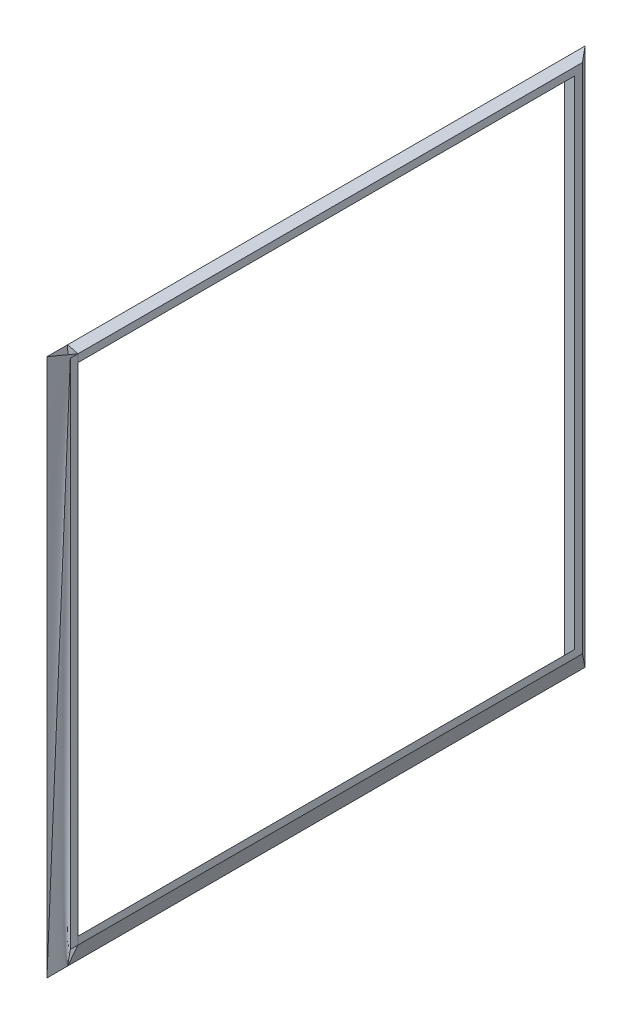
ISO-10303-21;
HEADER;
FILE_DESCRIPTION(('STEP AP214'),'2;1');
FILE_NAME('part.step','',(''),(''),'','','');
FILE_SCHEMA(('AUTOMOTIVE_DESIGN { 1 0 10303 214 1 1 1 1 }'));
ENDSEC;
DATA;
#1=APPLICATION_CONTEXT('core data for automotive mechanical design processes');
#2=APPLICATION_PROTOCOL_DEFINITION('international standard','automotive_design',2000,#1);
#3=PRODUCT_CONTEXT('',#1,'mechanical');
#4=PRODUCT('Part','Part','',(#3));
#5=PRODUCT_RELATED_PRODUCT_CATEGORY('part','',(#4));
#6=PRODUCT_DEFINITION_FORMATION('','',#4);
#7=PRODUCT_DEFINITION_CONTEXT('part definition',#1,'design');
#8=PRODUCT_DEFINITION('design','',#6,#7);
#9=PRODUCT_DEFINITION_SHAPE('','',#8);
#10=(LENGTH_UNIT() NAMED_UNIT(*) SI_UNIT(.MILLI.,.METRE.));
#11=(NAMED_UNIT(*) PLANE_ANGLE_UNIT() SI_UNIT($,.RADIAN.));
#12=(NAMED_UNIT(*) SI_UNIT($,.STERADIAN.) SOLID_ANGLE_UNIT());
#13=UNCERTAINTY_MEASURE_WITH_UNIT(LENGTH_MEASURE(1.E-05),#10,'distance_accuracy_value','');
#14=(GEOMETRIC_REPRESENTATION_CONTEXT(3) GLOBAL_UNCERTAINTY_ASSIGNED_CONTEXT((#13)) GLOBAL_UNIT_ASSIGNED_CONTEXT((#10,
#11,#12)) REPRESENTATION_CONTEXT('',''));
#15=CARTESIAN_POINT('',(0.,0.,0.));
#16=DIRECTION('',(0.,0.,1.));
#17=DIRECTION('',(1.,0.,0.));
#18=AXIS2_PLACEMENT_3D('',#15,#16,#17);
#19=CARTESIAN_POINT('',(0.,0.,-76.2));
#20=DIRECTION('',(0.,0.,-1.));
#21=DIRECTION('',(-1.,0.,0.));
#22=AXIS2_PLACEMENT_3D('',#19,#20,#21);
#23=PLANE('',#22);
#24=DIRECTION('',(0.707106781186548,0.707106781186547,0.));
#25=VECTOR('',#24,1.);
#26=CARTESIAN_POINT('',(0.,-76.2,-76.2));
#27=LINE('',#26,#25);
#28=CARTESIAN_POINT('',(0.,-76.2,-76.2));
#29=VERTEX_POINT('',#28);
#30=CARTESIAN_POINT('',(3.17500000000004,-73.025,-76.2));
#31=VERTEX_POINT('',#30);
#32=EDGE_CURVE('E109',#29,#31,#27,.T.);
#33=ORIENTED_EDGE('',*,*,#32,.T.);
#34=DIRECTION('',(0.,-1.,0.));
#35=VECTOR('',#34,1.);
#36=CARTESIAN_POINT('',(3.17500000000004,81.7372,-76.2));
#37=LINE('',#36,#35);
#38=CARTESIAN_POINT('',(3.17500000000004,79.375,-76.2));
#39=VERTEX_POINT('',#38);
#40=EDGE_CURVE('E13',#39,#31,#37,.T.);
#41=ORIENTED_EDGE('',*,*,#40,.F.);
#42=DIRECTION('',(0.707106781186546,0.707106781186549,0.));
#43=VECTOR('',#42,1.);
#44=CARTESIAN_POINT('',(0.,76.2,-76.2));
#45=LINE('',#44,#43);
#46=CARTESIAN_POINT('',(0.,76.2,-76.2));
#47=VERTEX_POINT('',#46);
#48=EDGE_CURVE('E477',#47,#39,#45,.T.);
#49=ORIENTED_EDGE('',*,*,#48,.F.);
#50=DIRECTION('',(0.,-1.,0.));
#51=VECTOR('',#50,1.);
#52=CARTESIAN_POINT('',(0.,82.55,-76.2));
#53=LINE('',#52,#51);
#54=EDGE_CURVE('E111',#47,#29,#53,.T.);
#55=ORIENTED_EDGE('',*,*,#54,.T.);
#56=EDGE_LOOP('',(#33,#41,#49,#55));
#57=FACE_BOUND('',#56,.T.);
#58=ADVANCED_FACE('F93',(#57),#23,.F.);
#59=CARTESIAN_POINT('',(3.17500000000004,0.,0.));
#60=DIRECTION('',(1.,0.,0.));
#61=DIRECTION('',(0.,0.,-1.));
#62=AXIS2_PLACEMENT_3D('',#59,#60,#61);
#63=PLANE('',#62);
#64=DIRECTION('',(0.,0.,-1.));
#65=VECTOR('',#64,1.);
#66=CARTESIAN_POINT('',(3.17500000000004,-75.3872,-76.2));
#67=LINE('',#66,#65);
#68=CARTESIAN_POINT('',(3.17500000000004,-75.3872,-76.2));
#69=VERTEX_POINT('',#68);
#70=CARTESIAN_POINT('',(3.17500000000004,-75.3872,-78.5622));
#71=VERTEX_POINT('',#70);
#72=EDGE_CURVE('E423',#69,#71,#67,.T.);
#73=ORIENTED_EDGE('',*,*,#72,.T.);
#74=DIRECTION('',(0.,1.,0.));
#75=VECTOR('',#74,1.);
#76=CARTESIAN_POINT('',(3.17500000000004,-75.3872,-78.5622));
#77=LINE('',#76,#75);
#78=CARTESIAN_POINT('',(3.17500000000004,81.7372,-78.5622));
#79=VERTEX_POINT('',#78);
#80=EDGE_CURVE('E412',#71,#79,#77,.T.);
#81=ORIENTED_EDGE('',*,*,#80,.T.);
#82=DIRECTION('',(0.,0.,1.));
#83=VECTOR('',#82,1.);
#84=CARTESIAN_POINT('',(3.17500000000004,81.7372,-78.5622));
#85=LINE('',#84,#83);
#86=CARTESIAN_POINT('',(3.17500000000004,81.7372,-76.2));
#87=VERTEX_POINT('',#86);
#88=EDGE_CURVE('E105',#79,#87,#85,.T.);
#89=ORIENTED_EDGE('',*,*,#88,.T.);
#90=DIRECTION('',(0.,0.,1.));
#91=VECTOR('',#90,1.);
#92=CARTESIAN_POINT('',(3.17500000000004,81.7372,-76.2));
#93=LINE('',#92,#91);
#94=CARTESIAN_POINT('',(3.17500000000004,81.7372,76.2));
#95=VERTEX_POINT('',#94);
#96=EDGE_CURVE('E470',#87,#95,#93,.T.);
#97=ORIENTED_EDGE('',*,*,#96,.T.);
#98=DIRECTION('',(0.,-1.,0.));
#99=VECTOR('',#98,1.);
#100=CARTESIAN_POINT('',(3.17500000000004,81.7372,76.2));
#101=LINE('',#100,#99);
#102=CARTESIAN_POINT('',(3.17500000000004,79.375,76.2));
#103=VERTEX_POINT('',#102);
#104=EDGE_CURVE('E462',#95,#103,#101,.T.);
#105=ORIENTED_EDGE('',*,*,#104,.T.);
#106=DIRECTION('',(0.,0.,-1.));
#107=VECTOR('',#106,1.);
#108=CARTESIAN_POINT('',(3.17500000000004,79.375,76.2));
#109=LINE('',#108,#107);
#110=EDGE_CURVE('E294',#103,#39,#109,.T.);
#111=ORIENTED_EDGE('',*,*,#110,.T.);
#112=ORIENTED_EDGE('',*,*,#40,.T.);
#113=DIRECTION('',(0.,0.,1.));
#114=VECTOR('',#113,1.);
#115=CARTESIAN_POINT('',(3.17500000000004,-73.025,-76.2));
#116=LINE('',#115,#114);
#117=CARTESIAN_POINT('',(3.17500000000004,-73.025,76.2));
#118=VERTEX_POINT('',#117);
#119=EDGE_CURVE('E242',#31,#118,#116,.T.);
#120=ORIENTED_EDGE('',*,*,#119,.T.);
#121=DIRECTION('',(0.,-1.,0.));
#122=VECTOR('',#121,1.);
#123=CARTESIAN_POINT('',(3.17500000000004,-73.025,76.2));
#124=LINE('',#123,#122);
#125=CARTESIAN_POINT('',(3.17500000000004,-75.3872,76.2));
#126=VERTEX_POINT('',#125);
#127=EDGE_CURVE('E199',#118,#126,#124,.T.);
#128=ORIENTED_EDGE('',*,*,#127,.T.);
#129=DIRECTION('',(0.,0.,-1.));
#130=VECTOR('',#129,1.);
#131=CARTESIAN_POINT('',(3.17500000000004,-75.3872,76.2));
#132=LINE('',#131,#130);
#133=EDGE_CURVE('E208',#126,#69,#132,.T.);
#134=ORIENTED_EDGE('',*,*,#133,.T.);
#135=EDGE_LOOP('',(#73,#81,#89,#97,#105,#111,#112,#120,#128,#134));
#136=FACE_BOUND('',#135,.T.);
#137=ADVANCED_FACE('F91',(#136),#63,.T.);
#138=CARTESIAN_POINT('',(0.,0.,0.));
#139=DIRECTION('',(1.,0.,0.));
#140=DIRECTION('',(0.,0.,-1.));
#141=AXIS2_PLACEMENT_3D('',#138,#139,#140);
#142=PLANE('',#141);
#143=DIRECTION('',(0.,0.,-1.));
#144=VECTOR('',#143,1.);
#145=CARTESIAN_POINT('',(0.,-82.55,-76.2));
#146=LINE('',#145,#144);
#147=CARTESIAN_POINT('',(0.,-82.55,-76.2));
#148=VERTEX_POINT('',#147);
#149=CARTESIAN_POINT('',(0.,-82.55,-82.55));
#150=VERTEX_POINT('',#149);
#151=EDGE_CURVE('E379',#148,#150,#146,.T.);
#152=ORIENTED_EDGE('',*,*,#151,.F.);
#153=DIRECTION('',(0.,0.,-1.));
#154=VECTOR('',#153,1.);
#155=CARTESIAN_POINT('',(0.,-82.55,76.2));
#156=LINE('',#155,#154);
#157=CARTESIAN_POINT('',(0.,-82.55,76.2));
#158=VERTEX_POINT('',#157);
#159=EDGE_CURVE('E180',#158,#148,#156,.T.);
#160=ORIENTED_EDGE('',*,*,#159,.F.);
#161=DIRECTION('',(0.,-1.,0.));
#162=VECTOR('',#161,1.);
#163=CARTESIAN_POINT('',(0.,-76.2,76.2));
#164=LINE('',#163,#162);
#165=CARTESIAN_POINT('',(0.,-76.2,76.2));
#166=VERTEX_POINT('',#165);
#167=EDGE_CURVE('E171',#166,#158,#164,.T.);
#168=ORIENTED_EDGE('',*,*,#167,.F.);
#169=DIRECTION('',(0.,0.,1.));
#170=VECTOR('',#169,1.);
#171=CARTESIAN_POINT('',(0.,-76.2,-76.2));
#172=LINE('',#171,#170);
#173=EDGE_CURVE('E175',#29,#166,#172,.T.);
#174=ORIENTED_EDGE('',*,*,#173,.F.);
#175=ORIENTED_EDGE('',*,*,#54,.F.);
#176=DIRECTION('',(0.,0.,-1.));
#177=VECTOR('',#176,1.);
#178=CARTESIAN_POINT('',(0.,76.2,76.2));
#179=LINE('',#178,#177);
#180=CARTESIAN_POINT('',(0.,76.2,76.2));
#181=VERTEX_POINT('',#180);
#182=EDGE_CURVE('E490',#181,#47,#179,.T.);
#183=ORIENTED_EDGE('',*,*,#182,.F.);
#184=DIRECTION('',(0.,-1.,0.));
#185=VECTOR('',#184,1.);
#186=CARTESIAN_POINT('',(0.,82.55,76.2));
#187=LINE('',#186,#185);
#188=CARTESIAN_POINT('',(0.,82.55,76.2));
#189=VERTEX_POINT('',#188);
#190=EDGE_CURVE('E258',#189,#181,#187,.T.);
#191=ORIENTED_EDGE('',*,*,#190,.F.);
#192=DIRECTION('',(0.,0.,1.));
#193=VECTOR('',#192,1.);
#194=CARTESIAN_POINT('',(0.,82.55,-76.2));
#195=LINE('',#194,#193);
#196=CARTESIAN_POINT('',(0.,82.55,-76.2));
#197=VERTEX_POINT('',#196);
#198=EDGE_CURVE('E481',#197,#189,#195,.T.);
#199=ORIENTED_EDGE('',*,*,#198,.F.);
#200=DIRECTION('',(0.,0.,1.));
#201=VECTOR('',#200,1.);
#202=CARTESIAN_POINT('',(0.,82.55,-82.55));
#203=LINE('',#202,#201);
#204=CARTESIAN_POINT('',(0.,82.55,-82.55));
#205=VERTEX_POINT('',#204);
#206=EDGE_CURVE('E356',#205,#197,#203,.T.);
#207=ORIENTED_EDGE('',*,*,#206,.F.);
#208=DIRECTION('',(0.,1.,0.));
#209=VECTOR('',#208,1.);
#210=CARTESIAN_POINT('',(0.,-82.55,-82.55));
#211=LINE('',#210,#209);
#212=EDGE_CURVE('E367',#150,#205,#211,.T.);
#213=ORIENTED_EDGE('',*,*,#212,.F.);
#214=EDGE_LOOP('',(#152,#160,#168,#174,#175,#183,#191,#199,#207,#213));
#215=FACE_BOUND('',#214,.T.);
#216=ADVANCED_FACE('F173',(#215),#142,.F.);
#217=CARTESIAN_POINT('',(30.5824286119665,-13.5560410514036,0.));
#218=DIRECTION('',(-0.914212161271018,0.405235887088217,0.));
#219=DIRECTION('',(-0.405235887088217,-0.914212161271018,0.));
#220=AXIS2_PLACEMENT_3D('',#217,#218,#219);
#221=PLANE('',#220);
#222=DIRECTION('',(0.361148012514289,0.814749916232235,0.453601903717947));
#223=VECTOR('',#222,1.);
#224=CARTESIAN_POINT('',(0.,-82.55,-82.55));
#225=LINE('',#224,#223);
#226=EDGE_CURVE('E442',#150,#71,#225,.T.);
#227=ORIENTED_EDGE('',*,*,#226,.T.);
#228=ORIENTED_EDGE('',*,*,#72,.F.);
#229=ORIENTED_EDGE('',*,*,#133,.F.);
#230=DIRECTION('',(0.405235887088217,0.914212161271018,0.));
#231=VECTOR('',#230,1.);
#232=CARTESIAN_POINT('',(0.,-82.55,76.2));
#233=LINE('',#232,#231);
#234=EDGE_CURVE('E183',#158,#126,#233,.T.);
#235=ORIENTED_EDGE('',*,*,#234,.F.);
#236=ORIENTED_EDGE('',*,*,#159,.T.);
#237=ORIENTED_EDGE('',*,*,#151,.T.);
#238=EDGE_LOOP('',(#227,#228,#229,#235,#236,#237));
#239=FACE_BOUND('',#238,.T.);
#240=ADVANCED_FACE('F320',(#239),#221,.F.);
#241=CARTESIAN_POINT('',(40.2255487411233,0.,-32.0267107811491));
#242=DIRECTION('',(-0.782325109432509,0.,0.62287031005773));
#243=DIRECTION('',(0.62287031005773,0.,0.782325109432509));
#244=AXIS2_PLACEMENT_3D('',#241,#242,#243);
#245=PLANE('',#244);
#246=DIRECTION('',(0.615099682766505,-0.157465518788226,0.77256520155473));
#247=VECTOR('',#246,1.);
#248=CARTESIAN_POINT('',(0.,82.55,-82.55));
#249=LINE('',#248,#247);
#250=EDGE_CURVE('E432',#205,#79,#249,.T.);
#251=ORIENTED_EDGE('',*,*,#250,.T.);
#252=ORIENTED_EDGE('',*,*,#80,.F.);
#253=ORIENTED_EDGE('',*,*,#226,.F.);
#254=ORIENTED_EDGE('',*,*,#212,.T.);
#255=EDGE_LOOP('',(#251,#252,#253,#254));
#256=FACE_BOUND('',#255,.T.);
#257=ADVANCED_FACE('F317',(#256),#245,.F.);
#258=CARTESIAN_POINT('',(19.8330230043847,77.4727461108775,0.));
#259=DIRECTION('',(-0.248002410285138,-0.968759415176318,0.));
#260=DIRECTION('',(0.968759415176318,-0.248002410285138,0.));
#261=AXIS2_PLACEMENT_3D('',#258,#259,#260);
#262=PLANE('',#261);
#263=ORIENTED_EDGE('',*,*,#206,.T.);
#264=ORIENTED_EDGE('',*,*,#198,.T.);
#265=DIRECTION('',(0.968759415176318,-0.248002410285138,0.));
#266=VECTOR('',#265,1.);
#267=CARTESIAN_POINT('',(0.,82.55,76.2));
#268=LINE('',#267,#266);
#269=EDGE_CURVE('E265',#189,#95,#268,.T.);
#270=ORIENTED_EDGE('',*,*,#269,.T.);
#271=ORIENTED_EDGE('',*,*,#96,.F.);
#272=ORIENTED_EDGE('',*,*,#88,.F.);
#273=ORIENTED_EDGE('',*,*,#250,.F.);
#274=EDGE_LOOP('',(#263,#264,#270,#271,#272,#273));
#275=FACE_BOUND('',#274,.T.);
#276=ADVANCED_FACE('F569',(#275),#262,.F.);
#277=CARTESIAN_POINT('',(-38.1,38.0999999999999,0.));
#278=DIRECTION('',(-0.707106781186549,0.707106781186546,0.));
#279=DIRECTION('',(-0.707106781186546,-0.707106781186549,0.));
#280=AXIS2_PLACEMENT_3D('',#277,#278,#279);
#281=PLANE('',#280);
#282=ORIENTED_EDGE('',*,*,#48,.T.);
#283=ORIENTED_EDGE('',*,*,#110,.F.);
#284=DIRECTION('',(0.707106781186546,0.707106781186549,0.));
#285=VECTOR('',#284,1.);
#286=CARTESIAN_POINT('',(0.,76.2,76.2));
#287=LINE('',#286,#285);
#288=EDGE_CURVE('E619',#181,#103,#287,.T.);
#289=ORIENTED_EDGE('',*,*,#288,.F.);
#290=ORIENTED_EDGE('',*,*,#182,.T.);
#291=EDGE_LOOP('',(#282,#283,#289,#290));
#292=FACE_BOUND('',#291,.T.);
#293=ADVANCED_FACE('F275',(#292),#281,.F.);
#294=CARTESIAN_POINT('',(0.,0.,76.2));
#295=DIRECTION('',(0.,0.,-1.));
#296=DIRECTION('',(-1.,0.,0.));
#297=AXIS2_PLACEMENT_3D('',#294,#295,#296);
#298=PLANE('',#297);
#299=ORIENTED_EDGE('',*,*,#288,.T.);
#300=ORIENTED_EDGE('',*,*,#104,.F.);
#301=ORIENTED_EDGE('',*,*,#269,.F.);
#302=ORIENTED_EDGE('',*,*,#190,.T.);
#303=EDGE_LOOP('',(#299,#300,#301,#302));
#304=FACE_BOUND('',#303,.T.);
#305=ADVANCED_FACE('F229',(#304),#298,.F.);
#306=CARTESIAN_POINT('',(0.,0.,76.2));
#307=DIRECTION('',(0.,0.,-1.));
#308=DIRECTION('',(-1.,0.,0.));
#309=AXIS2_PLACEMENT_3D('',#306,#307,#308);
#310=PLANE('',#309);
#311=ORIENTED_EDGE('',*,*,#234,.T.);
#312=ORIENTED_EDGE('',*,*,#127,.F.);
#313=DIRECTION('',(0.707106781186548,0.707106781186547,0.));
#314=VECTOR('',#313,1.);
#315=CARTESIAN_POINT('',(0.,-76.2,76.2));
#316=LINE('',#315,#314);
#317=EDGE_CURVE('E194',#166,#118,#316,.T.);
#318=ORIENTED_EDGE('',*,*,#317,.F.);
#319=ORIENTED_EDGE('',*,*,#167,.T.);
#320=EDGE_LOOP('',(#311,#312,#318,#319));
#321=FACE_BOUND('',#320,.T.);
#322=ADVANCED_FACE('F200',(#321),#310,.F.);
#323=CARTESIAN_POINT('',(38.1,-38.1,0.));
#324=DIRECTION('',(0.707106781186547,-0.707106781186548,0.));
#325=DIRECTION('',(0.707106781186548,0.707106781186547,0.));
#326=AXIS2_PLACEMENT_3D('',#323,#324,#325);
#327=PLANE('',#326);
#328=ORIENTED_EDGE('',*,*,#317,.T.);
#329=ORIENTED_EDGE('',*,*,#119,.F.);
#330=ORIENTED_EDGE('',*,*,#32,.F.);
#331=ORIENTED_EDGE('',*,*,#173,.T.);
#332=EDGE_LOOP('',(#328,#329,#330,#331));
#333=FACE_BOUND('',#332,.T.);
#334=ADVANCED_FACE('F192',(#333),#327,.F.);
#335=CLOSED_SHELL('',(#58,#137,#216,#240,#257,#276,#293,#305,#322,#334));
#336=MANIFOLD_SOLID_BREP('B2',#335);
#337=CARTESIAN_POINT('',(3.17500000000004,0.,0.));
#338=DIRECTION('',(1.,0.,0.));
#339=DIRECTION('',(0.,0.,-1.));
#340=AXIS2_PLACEMENT_3D('',#337,#338,#339);
#341=PLANE('',#340);
#342=DIRECTION('',(0.,0.,-1.));
#343=VECTOR('',#342,1.);
#344=CARTESIAN_POINT('',(3.17500000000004,-75.3872,78.5622));
#345=LINE('',#344,#343);
#346=CARTESIAN_POINT('',(3.17500000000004,-75.3872,78.5622));
#347=VERTEX_POINT('',#346);
#348=CARTESIAN_POINT('',(3.17500000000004,-75.3872,76.2));
#349=VERTEX_POINT('',#348);
#350=EDGE_CURVE('E955',#347,#349,#345,.T.);
#351=ORIENTED_EDGE('',*,*,#350,.T.);
#352=DIRECTION('',(0.,1.,0.));
#353=VECTOR('',#352,1.);
#354=CARTESIAN_POINT('',(3.17500000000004,-75.3872,76.2));
#355=LINE('',#354,#353);
#356=CARTESIAN_POINT('',(3.17500000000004,81.7372,76.2));
#357=VERTEX_POINT('',#356);
#358=EDGE_CURVE('E958',#349,#357,#355,.T.);
#359=ORIENTED_EDGE('',*,*,#358,.T.);
#360=DIRECTION('',(0.,0.,1.));
#361=VECTOR('',#360,1.);
#362=CARTESIAN_POINT('',(3.17500000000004,81.7372,76.2));
#363=LINE('',#362,#361);
#364=CARTESIAN_POINT('',(3.17500000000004,81.7372,78.5622));
#365=VERTEX_POINT('',#364);
#366=EDGE_CURVE('E894',#357,#365,#363,.T.);
#367=ORIENTED_EDGE('',*,*,#366,.T.);
#368=DIRECTION('',(0.,-1.,0.));
#369=VECTOR('',#368,1.);
#370=CARTESIAN_POINT('',(3.17500000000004,81.7372,78.5622));
#371=LINE('',#370,#369);
#372=EDGE_CURVE('E90',#365,#347,#371,.T.);
#373=ORIENTED_EDGE('',*,*,#372,.T.);
#374=EDGE_LOOP('',(#351,#359,#367,#373));
#375=FACE_BOUND('',#374,.T.);
#376=ADVANCED_FACE('F882',(#375),#341,.T.);
#377=CARTESIAN_POINT('',(0.,0.,0.));
#378=DIRECTION('',(1.,0.,0.));
#379=DIRECTION('',(0.,0.,-1.));
#380=AXIS2_PLACEMENT_3D('',#377,#378,#379);
#381=PLANE('',#380);
#382=DIRECTION('',(0.,0.,-1.));
#383=VECTOR('',#382,1.);
#384=CARTESIAN_POINT('',(0.,-82.55,82.55));
#385=LINE('',#384,#383);
#386=CARTESIAN_POINT('',(0.,-82.55,82.55));
#387=VERTEX_POINT('',#386);
#388=CARTESIAN_POINT('',(0.,-82.55,76.2));
#389=VERTEX_POINT('',#388);
#390=EDGE_CURVE('E927',#387,#389,#385,.T.);
#391=ORIENTED_EDGE('',*,*,#390,.F.);
#392=DIRECTION('',(0.,-1.,0.));
#393=VECTOR('',#392,1.);
#394=CARTESIAN_POINT('',(0.,82.55,82.55));
#395=LINE('',#394,#393);
#396=CARTESIAN_POINT('',(0.,82.55,82.55));
#397=VERTEX_POINT('',#396);
#398=EDGE_CURVE('E1094',#397,#387,#395,.T.);
#399=ORIENTED_EDGE('',*,*,#398,.F.);
#400=DIRECTION('',(0.,0.,1.));
#401=VECTOR('',#400,1.);
#402=CARTESIAN_POINT('',(0.,82.55,76.2));
#403=LINE('',#402,#401);
#404=CARTESIAN_POINT('',(0.,82.55,76.2));
#405=VERTEX_POINT('',#404);
#406=EDGE_CURVE('E935',#405,#397,#403,.T.);
#407=ORIENTED_EDGE('',*,*,#406,.F.);
#408=DIRECTION('',(0.,1.,0.));
#409=VECTOR('',#408,1.);
#410=CARTESIAN_POINT('',(0.,-82.55,76.2));
#411=LINE('',#410,#409);
#412=EDGE_CURVE('E924',#389,#405,#411,.T.);
#413=ORIENTED_EDGE('',*,*,#412,.F.);
#414=EDGE_LOOP('',(#391,#399,#407,#413));
#415=FACE_BOUND('',#414,.T.);
#416=ADVANCED_FACE('F928',(#415),#381,.F.);
#417=CARTESIAN_POINT('',(0.,82.55,76.2));
#418=CARTESIAN_POINT('',(3.17500000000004,-75.3872,76.2));
#419=CARTESIAN_POINT('',(0.,82.55,77.2583333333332));
#420=CARTESIAN_POINT('',(3.17500000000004,-49.1998,76.2));
#421=CARTESIAN_POINT('',(0.,82.55,78.3166666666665));
#422=CARTESIAN_POINT('',(3.17500000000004,-23.0124,76.2));
#423=CARTESIAN_POINT('',(0.,82.55,80.4333333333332));
#424=CARTESIAN_POINT('',(3.17500000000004,29.3624,76.2));
#425=CARTESIAN_POINT('',(0.,82.55,81.4916666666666));
#426=CARTESIAN_POINT('',(3.17500000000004,55.5498,76.2));
#427=CARTESIAN_POINT('',(0.,82.55,82.55));
#428=CARTESIAN_POINT('',(3.17500000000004,81.7372,76.2));
#429=B_SPLINE_SURFACE_WITH_KNOTS('',3,1,((#417,#418),(#419,#420),(#421,#422),(#423,#424),(#425,
#426),(#427,#428)),.UNSPECIFIED.,.F.,.F.,.F.,(4,2,4),(2,2),(0.,0.5,1.),(0.,1.),.UNSPECIFIED.);
#430=DIRECTION('',(0.444311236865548,-0.113743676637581,-0.888622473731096));
#431=VECTOR('',#430,1.);
#432=CARTESIAN_POINT('',(1.58749999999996,82.1436,79.375));
#433=LINE('',#432,#431);
#434=EDGE_CURVE('E962',#397,#357,#433,.T.);
#435=DIRECTION('',(-0.0200988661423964,0.999797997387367,0.));
#436=VECTOR('',#435,1.);
#437=CARTESIAN_POINT('',(1.58749999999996,3.5814,76.2));
#438=LINE('',#437,#436);
#439=EDGE_CURVE('E975',#349,#405,#438,.T.);
#440=ORIENTED_EDGE('',*,*,#406,.T.);
#441=ORIENTED_EDGE('',*,*,#434,.T.);
#442=ORIENTED_EDGE('',*,*,#358,.F.);
#443=ORIENTED_EDGE('',*,*,#439,.T.);
#444=EDGE_LOOP('',(#440,#441,#442,#443));
#445=FACE_BOUND('',#444,.T.);
#446=ADVANCED_FACE('F1017',(#445),#429,.T.);
#447=CARTESIAN_POINT('',(0.,82.55,82.55));
#448=CARTESIAN_POINT('',(3.17500000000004,81.7372,76.2));
#449=CARTESIAN_POINT('',(0.,55.0333333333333,82.55));
#450=CARTESIAN_POINT('',(3.17500000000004,81.7372,76.5937));
#451=CARTESIAN_POINT('',(0.,27.5166666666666,82.55));
#452=CARTESIAN_POINT('',(3.17500000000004,81.7372,76.9874));
#453=CARTESIAN_POINT('',(0.,-27.5166666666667,82.55));
#454=CARTESIAN_POINT('',(3.17500000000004,81.7372,77.7748));
#455=CARTESIAN_POINT('',(0.,-55.0333333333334,82.55));
#456=CARTESIAN_POINT('',(3.17500000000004,81.7372,78.1685));
#457=CARTESIAN_POINT('',(0.,-82.55,82.55));
#458=CARTESIAN_POINT('',(3.17500000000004,81.7372,78.5622));
#459=B_SPLINE_SURFACE_WITH_KNOTS('',3,1,((#447,#448),(#449,#450),(#451,#452),(#453,#454),(#455,
#456),(#457,#458)),.UNSPECIFIED.,.F.,.F.,.F.,(4,2,4),(2,2),(0.,0.5,1.),(0.,1.),.UNSPECIFIED.);
#460=DIRECTION('',(0.0193166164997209,0.999519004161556,-0.0242616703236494));
#461=VECTOR('',#460,1.);
#462=CARTESIAN_POINT('',(1.58749999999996,-0.406400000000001,80.5561));
#463=LINE('',#462,#461);
#464=EDGE_CURVE('E907',#387,#365,#463,.T.);
#465=ORIENTED_EDGE('',*,*,#398,.T.);
#466=ORIENTED_EDGE('',*,*,#464,.T.);
#467=ORIENTED_EDGE('',*,*,#366,.F.);
#468=ORIENTED_EDGE('',*,*,#434,.F.);
#469=EDGE_LOOP('',(#465,#466,#467,#468));
#470=FACE_BOUND('',#469,.T.);
#471=ADVANCED_FACE('F982',(#470),#459,.T.);
#472=CARTESIAN_POINT('',(0.,-82.55,76.2));
#473=CARTESIAN_POINT('',(3.17500000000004,-75.3872,78.5622));
#474=CARTESIAN_POINT('',(0.,-55.0333333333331,76.2));
#475=CARTESIAN_POINT('',(3.17500000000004,-75.3872,78.1685));
#476=CARTESIAN_POINT('',(0.,-27.5166666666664,76.2));
#477=CARTESIAN_POINT('',(3.17500000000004,-75.3872,77.7748));
#478=CARTESIAN_POINT('',(0.,27.5166666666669,76.2));
#479=CARTESIAN_POINT('',(3.17500000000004,-75.3872,76.9874));
#480=CARTESIAN_POINT('',(0.,55.0333333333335,76.2));
#481=CARTESIAN_POINT('',(3.17500000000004,-75.3872,76.5937));
#482=CARTESIAN_POINT('',(0.,82.55,76.2));
#483=CARTESIAN_POINT('',(3.17500000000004,-75.3872,76.2));
#484=B_SPLINE_SURFACE_WITH_KNOTS('',3,1,((#472,#473),(#474,#475),(#476,#477),(#478,#479),(#480,
#481),(#482,#483)),.UNSPECIFIED.,.F.,.F.,.F.,(4,2,4),(2,2),(0.,0.5,1.),(0.,1.),.UNSPECIFIED.);
#485=DIRECTION('',(0.387985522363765,0.875295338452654,0.288661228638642));
#486=VECTOR('',#485,1.);
#487=CARTESIAN_POINT('',(1.58749999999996,-78.9686,77.3811));
#488=LINE('',#487,#486);
#489=EDGE_CURVE('E946',#389,#347,#488,.T.);
#490=ORIENTED_EDGE('',*,*,#412,.T.);
#491=ORIENTED_EDGE('',*,*,#439,.F.);
#492=ORIENTED_EDGE('',*,*,#350,.F.);
#493=ORIENTED_EDGE('',*,*,#489,.F.);
#494=EDGE_LOOP('',(#490,#491,#492,#493));
#495=FACE_BOUND('',#494,.T.);
#496=ADVANCED_FACE('F952',(#495),#484,.T.);
#497=CARTESIAN_POINT('',(0.,-82.55,82.55));
#498=CARTESIAN_POINT('',(3.17500000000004,81.7372,78.5622));
#499=CARTESIAN_POINT('',(0.,-82.55,81.4916666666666));
#500=CARTESIAN_POINT('',(3.17500000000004,55.5498000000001,78.5622));
#501=CARTESIAN_POINT('',(0.,-82.55,80.4333333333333));
#502=CARTESIAN_POINT('',(3.17500000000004,29.3624000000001,78.5622));
#503=CARTESIAN_POINT('',(0.,-82.55,78.3166666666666));
#504=CARTESIAN_POINT('',(3.17500000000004,-23.0123999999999,78.5622));
#505=CARTESIAN_POINT('',(0.,-82.55,77.2583333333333));
#506=CARTESIAN_POINT('',(3.17500000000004,-49.1997999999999,78.5622));
#507=CARTESIAN_POINT('',(0.,-82.55,76.2));
#508=CARTESIAN_POINT('',(3.17500000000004,-75.3872,78.5622));
#509=B_SPLINE_SURFACE_WITH_KNOTS('',3,1,((#497,#498),(#499,#500),(#501,#502),(#503,#504),(#505,
#506),(#507,#508)),.UNSPECIFIED.,.F.,.F.,.F.,(4,2,4),(2,2),(0.,0.5,1.),(0.,1.),.UNSPECIFIED.);
#510=ORIENTED_EDGE('',*,*,#390,.T.);
#511=ORIENTED_EDGE('',*,*,#489,.T.);
#512=ORIENTED_EDGE('',*,*,#372,.F.);
#513=ORIENTED_EDGE('',*,*,#464,.F.);
#514=EDGE_LOOP('',(#510,#511,#512,#513));
#515=FACE_BOUND('',#514,.T.);
#516=ADVANCED_FACE('F949',(#515),#509,.T.);
#517=CLOSED_SHELL('',(#376,#416,#446,#471,#496,#516));
#518=MANIFOLD_SOLID_BREP('B7',#517);
#519=ADVANCED_BREP_SHAPE_REPRESENTATION('',(#18,#336,#518),#14);
#520=SHAPE_DEFINITION_REPRESENTATION(#9,#519);
ENDSEC;
END-ISO-10303-21;
